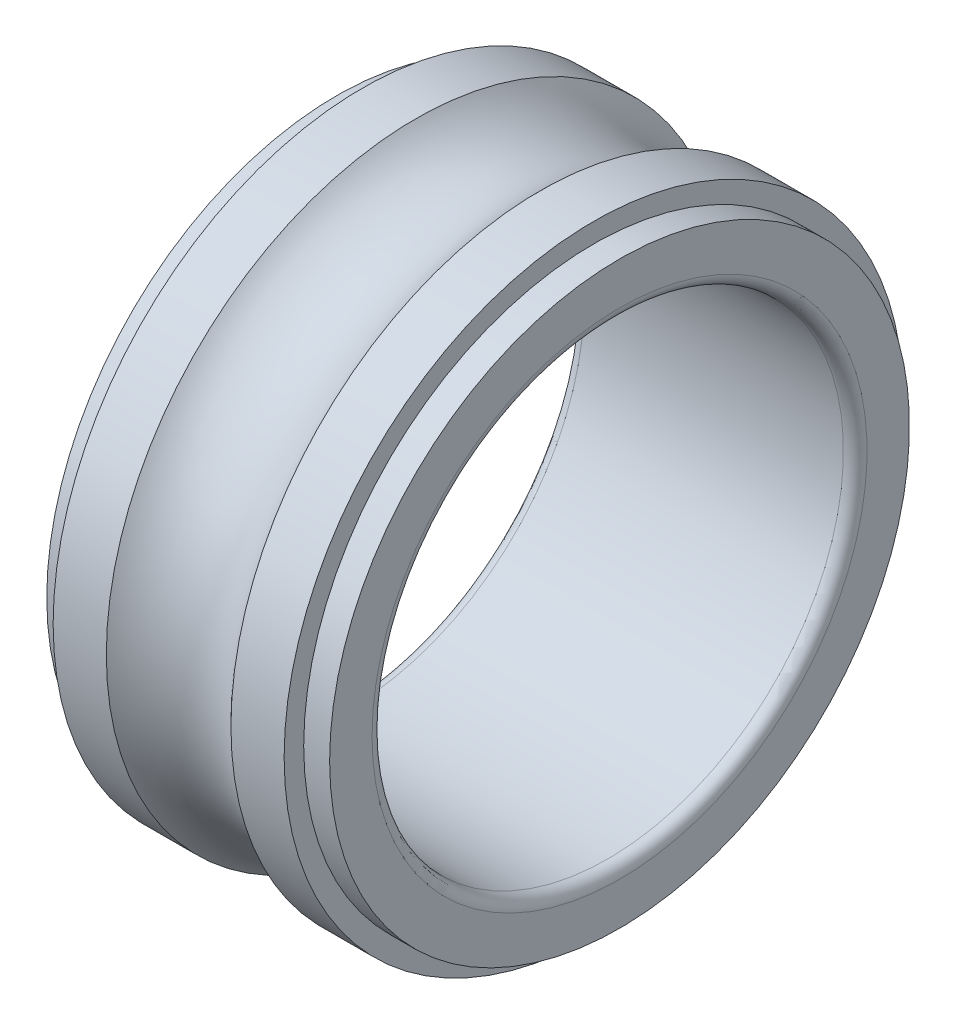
ISO-10303-21;
HEADER;
FILE_DESCRIPTION(('STEP AP214'),'2;1');
FILE_NAME('part.step','',(''),(''),'','','');
FILE_SCHEMA(('AUTOMOTIVE_DESIGN { 1 0 10303 214 1 1 1 1 }'));
ENDSEC;
DATA;
#1=APPLICATION_CONTEXT('core data for automotive mechanical design processes');
#2=APPLICATION_PROTOCOL_DEFINITION('international standard','automotive_design',2000,#1);
#3=PRODUCT_CONTEXT('',#1,'mechanical');
#4=PRODUCT('Part','Part','',(#3));
#5=PRODUCT_RELATED_PRODUCT_CATEGORY('part','',(#4));
#6=PRODUCT_DEFINITION_FORMATION('','',#4);
#7=PRODUCT_DEFINITION_CONTEXT('part definition',#1,'design');
#8=PRODUCT_DEFINITION('design','',#6,#7);
#9=PRODUCT_DEFINITION_SHAPE('','',#8);
#10=(LENGTH_UNIT() NAMED_UNIT(*) SI_UNIT(.MILLI.,.METRE.));
#11=(NAMED_UNIT(*) PLANE_ANGLE_UNIT() SI_UNIT($,.RADIAN.));
#12=(NAMED_UNIT(*) SI_UNIT($,.STERADIAN.) SOLID_ANGLE_UNIT());
#13=UNCERTAINTY_MEASURE_WITH_UNIT(LENGTH_MEASURE(1.E-05),#10,'distance_accuracy_value','');
#14=(GEOMETRIC_REPRESENTATION_CONTEXT(3) GLOBAL_UNCERTAINTY_ASSIGNED_CONTEXT((#13)) GLOBAL_UNIT_ASSIGNED_CONTEXT((#10,
#11,#12)) REPRESENTATION_CONTEXT('',''));
#15=CARTESIAN_POINT('',(0.,0.,0.));
#16=DIRECTION('',(0.,0.,1.));
#17=DIRECTION('',(1.,0.,0.));
#18=AXIS2_PLACEMENT_3D('',#15,#16,#17);
#19=CARTESIAN_POINT('',(-24.3202429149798,0.,0.));
#20=DIRECTION('',(-1.,0.,0.));
#21=DIRECTION('',(0.,0.,1.));
#22=AXIS2_PLACEMENT_3D('',#19,#20,#21);
#23=CYLINDRICAL_SURFACE('',#22,12.3);
#24=CARTESIAN_POINT('',(4.9,0.,0.));
#25=DIRECTION('',(-1.,0.,0.));
#26=DIRECTION('',(0.,0.,1.));
#27=AXIS2_PLACEMENT_3D('',#24,#25,#26);
#28=CIRCLE('',#27,12.3);
#29=CARTESIAN_POINT('',(4.9,0.,12.3));
#30=VERTEX_POINT('',#29);
#31=EDGE_CURVE('E10',#30,#30,#28,.T.);
#32=ORIENTED_EDGE('',*,*,#31,.F.);
#33=EDGE_LOOP('',(#32));
#34=FACE_BOUND('',#33,.T.);
#35=CARTESIAN_POINT('',(6.00000000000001,0.,0.));
#36=DIRECTION('',(-1.,0.,0.));
#37=DIRECTION('',(0.,0.,1.));
#38=AXIS2_PLACEMENT_3D('',#35,#36,#37);
#39=CIRCLE('',#38,12.3);
#40=CARTESIAN_POINT('',(6.00000000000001,0.,12.3));
#41=VERTEX_POINT('',#40);
#42=EDGE_CURVE('E70',#41,#41,#39,.T.);
#43=ORIENTED_EDGE('',*,*,#42,.T.);
#44=EDGE_LOOP('',(#43));
#45=FACE_BOUND('',#44,.T.);
#46=ADVANCED_FACE('F30',(#34,#45),#23,.T.);
#47=CARTESIAN_POINT('',(4.9,13.13,0.));
#48=DIRECTION('',(-1.,0.,0.));
#49=DIRECTION('',(0.,0.,1.));
#50=AXIS2_PLACEMENT_3D('',#47,#48,#49);
#51=PLANE('',#50);
#52=CARTESIAN_POINT('',(4.9,0.,0.));
#53=DIRECTION('',(-1.,0.,0.));
#54=DIRECTION('',(0.,0.,1.));
#55=AXIS2_PLACEMENT_3D('',#52,#53,#54);
#56=CIRCLE('',#55,13.13);
#57=CARTESIAN_POINT('',(4.9,0.,13.13));
#58=VERTEX_POINT('',#57);
#59=EDGE_CURVE('E36',#58,#58,#56,.T.);
#60=ORIENTED_EDGE('',*,*,#59,.F.);
#61=EDGE_LOOP('',(#60));
#62=FACE_BOUND('',#61,.T.);
#63=ORIENTED_EDGE('',*,*,#31,.T.);
#64=EDGE_LOOP('',(#63));
#65=FACE_BOUND('',#64,.T.);
#66=ADVANCED_FACE('F131',(#62,#65),#51,.F.);
#67=CARTESIAN_POINT('',(-24.3202429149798,0.,0.));
#68=DIRECTION('',(-1.,0.,0.));
#69=DIRECTION('',(0.,0.,1.));
#70=AXIS2_PLACEMENT_3D('',#67,#68,#69);
#71=CYLINDRICAL_SURFACE('',#70,13.13);
#72=CARTESIAN_POINT('',(2.64302856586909,0.,0.));
#73=DIRECTION('',(-1.,0.,0.));
#74=DIRECTION('',(0.,0.,1.));
#75=AXIS2_PLACEMENT_3D('',#72,#73,#74);
#76=CIRCLE('',#75,13.13);
#77=CARTESIAN_POINT('',(2.64302856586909,0.,13.13));
#78=VERTEX_POINT('',#77);
#79=EDGE_CURVE('E40',#78,#78,#76,.T.);
#80=ORIENTED_EDGE('',*,*,#79,.F.);
#81=EDGE_LOOP('',(#80));
#82=FACE_BOUND('',#81,.T.);
#83=ORIENTED_EDGE('',*,*,#59,.T.);
#84=EDGE_LOOP('',(#83));
#85=FACE_BOUND('',#84,.T.);
#86=ADVANCED_FACE('F126',(#82,#85),#71,.T.);
#87=CARTESIAN_POINT('',(0.,0.,0.));
#88=DIRECTION('',(-1.,0.,0.));
#89=DIRECTION('',(0.,0.,1.));
#90=AXIS2_PLACEMENT_3D('',#87,#88,#89);
#91=TOROIDAL_SURFACE('',#90,15.5,3.55);
#92=CARTESIAN_POINT('',(-2.64302856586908,0.,0.));
#93=DIRECTION('',(-1.,0.,0.));
#94=DIRECTION('',(0.,0.,1.));
#95=AXIS2_PLACEMENT_3D('',#92,#93,#94);
#96=CIRCLE('',#95,13.13);
#97=CARTESIAN_POINT('',(-2.64302856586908,0.,13.13));
#98=VERTEX_POINT('',#97);
#99=EDGE_CURVE('E44',#98,#98,#96,.T.);
#100=ORIENTED_EDGE('',*,*,#99,.F.);
#101=EDGE_LOOP('',(#100));
#102=FACE_BOUND('',#101,.T.);
#103=ORIENTED_EDGE('',*,*,#79,.T.);
#104=EDGE_LOOP('',(#103));
#105=FACE_BOUND('',#104,.T.);
#106=ADVANCED_FACE('F120',(#102,#105),#91,.F.);
#107=CARTESIAN_POINT('',(-24.3202429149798,0.,0.));
#108=DIRECTION('',(-1.,0.,0.));
#109=DIRECTION('',(0.,0.,1.));
#110=AXIS2_PLACEMENT_3D('',#107,#108,#109);
#111=CYLINDRICAL_SURFACE('',#110,13.13);
#112=CARTESIAN_POINT('',(-4.9,0.,0.));
#113=DIRECTION('',(-1.,0.,0.));
#114=DIRECTION('',(0.,0.,1.));
#115=AXIS2_PLACEMENT_3D('',#112,#113,#114);
#116=CIRCLE('',#115,13.13);
#117=CARTESIAN_POINT('',(-4.9,0.,13.13));
#118=VERTEX_POINT('',#117);
#119=EDGE_CURVE('E49',#118,#118,#116,.T.);
#120=ORIENTED_EDGE('',*,*,#119,.F.);
#121=EDGE_LOOP('',(#120));
#122=FACE_BOUND('',#121,.T.);
#123=ORIENTED_EDGE('',*,*,#99,.T.);
#124=EDGE_LOOP('',(#123));
#125=FACE_BOUND('',#124,.T.);
#126=ADVANCED_FACE('F114',(#122,#125),#111,.T.);
#127=CARTESIAN_POINT('',(-4.9,13.13,0.));
#128=DIRECTION('',(1.,0.,0.));
#129=DIRECTION('',(0.,0.,-1.));
#130=AXIS2_PLACEMENT_3D('',#127,#128,#129);
#131=PLANE('',#130);
#132=CARTESIAN_POINT('',(-4.9,0.,0.));
#133=DIRECTION('',(-1.,0.,0.));
#134=DIRECTION('',(0.,0.,1.));
#135=AXIS2_PLACEMENT_3D('',#132,#133,#134);
#136=CIRCLE('',#135,12.3);
#137=CARTESIAN_POINT('',(-4.9,0.,12.3));
#138=VERTEX_POINT('',#137);
#139=EDGE_CURVE('E52',#138,#138,#136,.T.);
#140=ORIENTED_EDGE('',*,*,#139,.F.);
#141=EDGE_LOOP('',(#140));
#142=FACE_BOUND('',#141,.T.);
#143=ORIENTED_EDGE('',*,*,#119,.T.);
#144=EDGE_LOOP('',(#143));
#145=FACE_BOUND('',#144,.T.);
#146=ADVANCED_FACE('F108',(#142,#145),#131,.F.);
#147=CARTESIAN_POINT('',(-24.3202429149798,0.,0.));
#148=DIRECTION('',(-1.,0.,0.));
#149=DIRECTION('',(0.,0.,1.));
#150=AXIS2_PLACEMENT_3D('',#147,#148,#149);
#151=CYLINDRICAL_SURFACE('',#150,12.3);
#152=CARTESIAN_POINT('',(-6.,0.,0.));
#153=DIRECTION('',(-1.,0.,0.));
#154=DIRECTION('',(0.,0.,1.));
#155=AXIS2_PLACEMENT_3D('',#152,#153,#154);
#156=CIRCLE('',#155,12.3);
#157=CARTESIAN_POINT('',(-6.,0.,12.3));
#158=VERTEX_POINT('',#157);
#159=EDGE_CURVE('E55',#158,#158,#156,.T.);
#160=ORIENTED_EDGE('',*,*,#159,.F.);
#161=EDGE_LOOP('',(#160));
#162=FACE_BOUND('',#161,.T.);
#163=ORIENTED_EDGE('',*,*,#139,.T.);
#164=EDGE_LOOP('',(#163));
#165=FACE_BOUND('',#164,.T.);
#166=ADVANCED_FACE('F102',(#162,#165),#151,.T.);
#167=CARTESIAN_POINT('',(-6.,12.3,0.));
#168=DIRECTION('',(1.,0.,0.));
#169=DIRECTION('',(0.,0.,-1.));
#170=AXIS2_PLACEMENT_3D('',#167,#168,#169);
#171=PLANE('',#170);
#172=CARTESIAN_POINT('',(-6.,0.,0.));
#173=DIRECTION('',(-1.,0.,0.));
#174=DIRECTION('',(0.,0.,1.));
#175=AXIS2_PLACEMENT_3D('',#172,#173,#174);
#176=CIRCLE('',#175,10.5);
#177=CARTESIAN_POINT('',(-6.,0.,10.5));
#178=VERTEX_POINT('',#177);
#179=EDGE_CURVE('E58',#178,#178,#176,.T.);
#180=ORIENTED_EDGE('',*,*,#179,.F.);
#181=EDGE_LOOP('',(#180));
#182=FACE_BOUND('',#181,.T.);
#183=ORIENTED_EDGE('',*,*,#159,.T.);
#184=EDGE_LOOP('',(#183));
#185=FACE_BOUND('',#184,.T.);
#186=ADVANCED_FACE('F96',(#182,#185),#171,.F.);
#187=CARTESIAN_POINT('',(-5.5,0.,0.));
#188=DIRECTION('',(-1.,0.,0.));
#189=DIRECTION('',(0.,0.,1.));
#190=AXIS2_PLACEMENT_3D('',#187,#188,#189);
#191=TOROIDAL_SURFACE('',#190,10.5,0.5);
#192=CARTESIAN_POINT('',(-5.49999999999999,0.,0.));
#193=DIRECTION('',(-1.,0.,0.));
#194=DIRECTION('',(0.,0.,1.));
#195=AXIS2_PLACEMENT_3D('',#192,#193,#194);
#196=CIRCLE('',#195,10.);
#197=CARTESIAN_POINT('',(-5.49999999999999,0.,10.));
#198=VERTEX_POINT('',#197);
#199=EDGE_CURVE('E61',#198,#198,#196,.T.);
#200=ORIENTED_EDGE('',*,*,#199,.F.);
#201=EDGE_LOOP('',(#200));
#202=FACE_BOUND('',#201,.T.);
#203=ORIENTED_EDGE('',*,*,#179,.T.);
#204=EDGE_LOOP('',(#203));
#205=FACE_BOUND('',#204,.T.);
#206=ADVANCED_FACE('F90',(#202,#205),#191,.T.);
#207=CARTESIAN_POINT('',(-24.3202429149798,0.,0.));
#208=DIRECTION('',(-1.,0.,0.));
#209=DIRECTION('',(0.,0.,1.));
#210=AXIS2_PLACEMENT_3D('',#207,#208,#209);
#211=CYLINDRICAL_SURFACE('',#210,10.);
#212=CARTESIAN_POINT('',(5.5,0.,0.));
#213=DIRECTION('',(-1.,0.,0.));
#214=DIRECTION('',(0.,0.,1.));
#215=AXIS2_PLACEMENT_3D('',#212,#213,#214);
#216=CIRCLE('',#215,10.);
#217=CARTESIAN_POINT('',(5.5,0.,10.));
#218=VERTEX_POINT('',#217);
#219=EDGE_CURVE('E64',#218,#218,#216,.T.);
#220=ORIENTED_EDGE('',*,*,#219,.F.);
#221=EDGE_LOOP('',(#220));
#222=FACE_BOUND('',#221,.T.);
#223=ORIENTED_EDGE('',*,*,#199,.T.);
#224=EDGE_LOOP('',(#223));
#225=FACE_BOUND('',#224,.T.);
#226=ADVANCED_FACE('F84',(#222,#225),#211,.F.);
#227=CARTESIAN_POINT('',(5.50000000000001,0.,0.));
#228=DIRECTION('',(-1.,0.,0.));
#229=DIRECTION('',(0.,0.,1.));
#230=AXIS2_PLACEMENT_3D('',#227,#228,#229);
#231=TOROIDAL_SURFACE('',#230,10.5,0.5);
#232=CARTESIAN_POINT('',(6.00000000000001,0.,0.));
#233=DIRECTION('',(-1.,0.,0.));
#234=DIRECTION('',(0.,0.,1.));
#235=AXIS2_PLACEMENT_3D('',#232,#233,#234);
#236=CIRCLE('',#235,10.5);
#237=CARTESIAN_POINT('',(6.00000000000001,0.,10.5));
#238=VERTEX_POINT('',#237);
#239=EDGE_CURVE('E67',#238,#238,#236,.T.);
#240=ORIENTED_EDGE('',*,*,#239,.F.);
#241=EDGE_LOOP('',(#240));
#242=FACE_BOUND('',#241,.T.);
#243=ORIENTED_EDGE('',*,*,#219,.T.);
#244=EDGE_LOOP('',(#243));
#245=FACE_BOUND('',#244,.T.);
#246=ADVANCED_FACE('F78',(#242,#245),#231,.T.);
#247=CARTESIAN_POINT('',(6.,12.3,0.));
#248=DIRECTION('',(-1.,0.,0.));
#249=DIRECTION('',(0.,0.,1.));
#250=AXIS2_PLACEMENT_3D('',#247,#248,#249);
#251=PLANE('',#250);
#252=ORIENTED_EDGE('',*,*,#42,.F.);
#253=EDGE_LOOP('',(#252));
#254=FACE_BOUND('',#253,.T.);
#255=ORIENTED_EDGE('',*,*,#239,.T.);
#256=EDGE_LOOP('',(#255));
#257=FACE_BOUND('',#256,.T.);
#258=ADVANCED_FACE('F75',(#254,#257),#251,.F.);
#259=CLOSED_SHELL('',(#46,#66,#86,#106,#126,#146,#166,#186,#206,#226,#246,#258));
#260=MANIFOLD_SOLID_BREP('B2',#259);
#261=ADVANCED_BREP_SHAPE_REPRESENTATION('',(#18,#260),#14);
#262=SHAPE_DEFINITION_REPRESENTATION(#9,#261);
ENDSEC;
END-ISO-10303-21;
